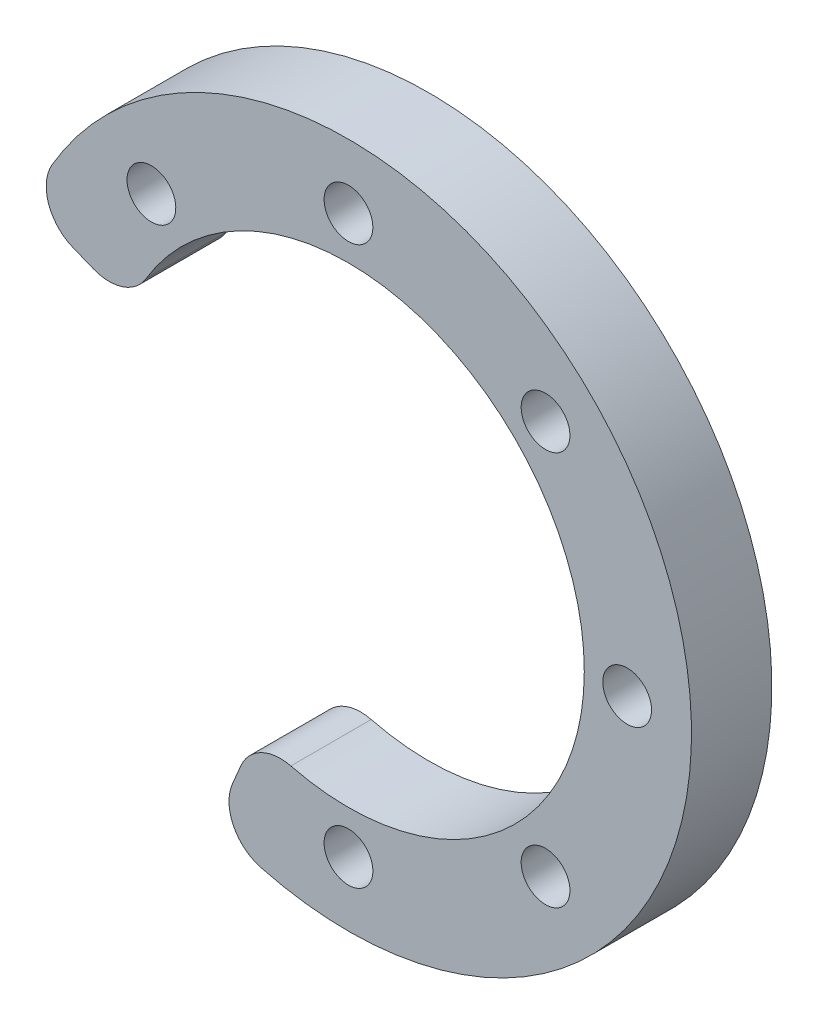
ISO-10303-21;
HEADER;
FILE_DESCRIPTION(('STEP AP214'),'2;1');
FILE_NAME('part.step','',(''),(''),'','','');
FILE_SCHEMA(('AUTOMOTIVE_DESIGN { 1 0 10303 214 1 1 1 1 }'));
ENDSEC;
DATA;
#1=APPLICATION_CONTEXT('core data for automotive mechanical design processes');
#2=APPLICATION_PROTOCOL_DEFINITION('international standard','automotive_design',2000,#1);
#3=PRODUCT_CONTEXT('',#1,'mechanical');
#4=PRODUCT('Part','Part','',(#3));
#5=PRODUCT_RELATED_PRODUCT_CATEGORY('part','',(#4));
#6=PRODUCT_DEFINITION_FORMATION('','',#4);
#7=PRODUCT_DEFINITION_CONTEXT('part definition',#1,'design');
#8=PRODUCT_DEFINITION('design','',#6,#7);
#9=PRODUCT_DEFINITION_SHAPE('','',#8);
#10=(LENGTH_UNIT() NAMED_UNIT(*) SI_UNIT(.MILLI.,.METRE.));
#11=(NAMED_UNIT(*) PLANE_ANGLE_UNIT() SI_UNIT($,.RADIAN.));
#12=(NAMED_UNIT(*) SI_UNIT($,.STERADIAN.) SOLID_ANGLE_UNIT());
#13=UNCERTAINTY_MEASURE_WITH_UNIT(LENGTH_MEASURE(1.E-05),#10,'distance_accuracy_value','');
#14=(GEOMETRIC_REPRESENTATION_CONTEXT(3) GLOBAL_UNCERTAINTY_ASSIGNED_CONTEXT((#13)) GLOBAL_UNIT_ASSIGNED_CONTEXT((#10,
#11,#12)) REPRESENTATION_CONTEXT('',''));
#15=CARTESIAN_POINT('',(0.,0.,0.));
#16=DIRECTION('',(0.,0.,1.));
#17=DIRECTION('',(1.,0.,0.));
#18=AXIS2_PLACEMENT_3D('',#15,#16,#17);
#19=CARTESIAN_POINT('',(-22.3213581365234,13.3325530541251,7.5));
#20=DIRECTION('',(0.,0.,-1.));
#21=DIRECTION('',(-1.,0.,0.));
#22=AXIS2_PLACEMENT_3D('',#19,#20,#21);
#23=CYLINDRICAL_SURFACE('',#22,4.);
#24=CARTESIAN_POINT('',(-22.3213581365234,13.3325530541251,0.));
#25=DIRECTION('',(0.,0.,-1.));
#26=DIRECTION('',(1.,0.,0.));
#27=AXIS2_PLACEMENT_3D('',#24,#25,#26);
#28=CIRCLE('',#27,4.);
#29=CARTESIAN_POINT('',(-18.8873030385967,11.2813910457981,0.));
#30=VERTEX_POINT('',#29);
#31=CARTESIAN_POINT('',(-23.8197845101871,9.62381763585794,0.));
#32=VERTEX_POINT('',#31);
#33=EDGE_CURVE('E137',#30,#32,#28,.T.);
#34=ORIENTED_EDGE('',*,*,#33,.F.);
#35=DIRECTION('',(0.,0.,-1.));
#36=VECTOR('',#35,1.);
#37=CARTESIAN_POINT('',(-18.8873030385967,11.2813910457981,7.5));
#38=LINE('',#37,#36);
#39=CARTESIAN_POINT('',(-18.8873030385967,11.2813910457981,7.5));
#40=VERTEX_POINT('',#39);
#41=EDGE_CURVE('E51',#40,#30,#38,.T.);
#42=ORIENTED_EDGE('',*,*,#41,.F.);
#43=CARTESIAN_POINT('',(-22.3213581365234,13.3325530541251,7.5));
#44=DIRECTION('',(0.,0.,1.));
#45=DIRECTION('',(1.,0.,0.));
#46=AXIS2_PLACEMENT_3D('',#43,#44,#45);
#47=CIRCLE('',#46,4.);
#48=CARTESIAN_POINT('',(-23.8197845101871,9.62381763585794,7.5));
#49=VERTEX_POINT('',#48);
#50=EDGE_CURVE('E178',#49,#40,#47,.T.);
#51=ORIENTED_EDGE('',*,*,#50,.F.);
#52=DIRECTION('',(0.,0.,1.));
#53=VECTOR('',#52,1.);
#54=CARTESIAN_POINT('',(-23.8197845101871,9.62381763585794,7.5));
#55=LINE('',#54,#53);
#56=EDGE_CURVE('E11',#32,#49,#55,.T.);
#57=ORIENTED_EDGE('',*,*,#56,.F.);
#58=EDGE_LOOP('',(#34,#42,#51,#57));
#59=FACE_BOUND('',#58,.T.);
#60=ADVANCED_FACE('F17',(#59),#23,.T.);
#61=CARTESIAN_POINT('',(-6.35604502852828,-25.2111223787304,7.5));
#62=DIRECTION('',(0.,0.,-1.));
#63=DIRECTION('',(-1.,0.,0.));
#64=AXIS2_PLACEMENT_3D('',#61,#62,#63);
#65=CYLINDRICAL_SURFACE('',#64,4.);
#66=CARTESIAN_POINT('',(-6.35604502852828,-25.2111223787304,7.5));
#67=DIRECTION('',(0.,0.,1.));
#68=DIRECTION('',(1.,0.,0.));
#69=AXIS2_PLACEMENT_3D('',#66,#67,#68);
#70=CIRCLE('',#69,4.);
#71=CARTESIAN_POINT('',(-5.37819194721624,-21.332488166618,7.5));
#72=VERTEX_POINT('',#71);
#73=CARTESIAN_POINT('',(-10.038064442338,-23.6481978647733,7.5));
#74=VERTEX_POINT('',#73);
#75=EDGE_CURVE('E131',#72,#74,#70,.T.);
#76=ORIENTED_EDGE('',*,*,#75,.F.);
#77=DIRECTION('',(0.,0.,1.));
#78=VECTOR('',#77,1.);
#79=CARTESIAN_POINT('',(-5.37819194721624,-21.332488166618,7.5));
#80=LINE('',#79,#78);
#81=CARTESIAN_POINT('',(-5.37819194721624,-21.332488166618,0.));
#82=VERTEX_POINT('',#81);
#83=EDGE_CURVE('E113',#82,#72,#80,.T.);
#84=ORIENTED_EDGE('',*,*,#83,.F.);
#85=CARTESIAN_POINT('',(-6.35604502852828,-25.2111223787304,0.));
#86=DIRECTION('',(0.,0.,-1.));
#87=DIRECTION('',(1.,0.,0.));
#88=AXIS2_PLACEMENT_3D('',#85,#86,#87);
#89=CIRCLE('',#88,4.);
#90=CARTESIAN_POINT('',(-10.038064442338,-23.6481978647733,0.));
#91=VERTEX_POINT('',#90);
#92=EDGE_CURVE('E111',#91,#82,#89,.T.);
#93=ORIENTED_EDGE('',*,*,#92,.F.);
#94=DIRECTION('',(0.,0.,-1.));
#95=VECTOR('',#94,1.);
#96=CARTESIAN_POINT('',(-10.038064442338,-23.6481978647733,0.));
#97=LINE('',#96,#95);
#98=EDGE_CURVE('E20',#74,#91,#97,.T.);
#99=ORIENTED_EDGE('',*,*,#98,.F.);
#100=EDGE_LOOP('',(#76,#84,#93,#99));
#101=FACE_BOUND('',#100,.T.);
#102=ADVANCED_FACE('F112',(#101),#65,.T.);
#103=CARTESIAN_POINT('',(0.,0.,0.));
#104=DIRECTION('',(0.374606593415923,0.927183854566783,0.));
#105=DIRECTION('',(0.,0.,-1.));
#106=AXIS2_PLACEMENT_3D('',#103,#104,#105);
#107=PLANE('',#106);
#108=DIRECTION('',(-0.927183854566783,0.374606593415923,0.));
#109=VECTOR('',#108,1.);
#110=CARTESIAN_POINT('',(0.,0.,0.));
#111=LINE('',#110,#109);
#112=CARTESIAN_POINT('',(-25.6948727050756,10.3814024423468,0.));
#113=VERTEX_POINT('',#112);
#114=EDGE_CURVE('E141',#32,#113,#111,.T.);
#115=ORIENTED_EDGE('',*,*,#114,.F.);
#116=ORIENTED_EDGE('',*,*,#56,.T.);
#117=DIRECTION('',(-0.927183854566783,0.374606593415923,0.));
#118=VECTOR('',#117,1.);
#119=CARTESIAN_POINT('',(0.,0.,7.5));
#120=LINE('',#119,#118);
#121=CARTESIAN_POINT('',(-25.6948727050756,10.3814024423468,7.5));
#122=VERTEX_POINT('',#121);
#123=EDGE_CURVE('E167',#49,#122,#120,.T.);
#124=ORIENTED_EDGE('',*,*,#123,.T.);
#125=DIRECTION('',(0.,0.,-1.));
#126=VECTOR('',#125,1.);
#127=CARTESIAN_POINT('',(-25.6948727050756,10.3814024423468,0.));
#128=LINE('',#127,#126);
#129=EDGE_CURVE('E276',#122,#113,#128,.T.);
#130=ORIENTED_EDGE('',*,*,#129,.T.);
#131=EDGE_LOOP('',(#115,#116,#124,#130));
#132=FACE_BOUND('',#131,.T.);
#133=ADVANCED_FACE('F265',(#132),#107,.F.);
#134=CARTESIAN_POINT('',(0.,0.,0.));
#135=DIRECTION('',(0.92050485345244,-0.390731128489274,0.));
#136=DIRECTION('',(0.,0.,-1.));
#137=AXIS2_PLACEMENT_3D('',#134,#135,#136);
#138=PLANE('',#137);
#139=DIRECTION('',(0.390731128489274,0.92050485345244,0.));
#140=VECTOR('',#139,1.);
#141=CARTESIAN_POINT('',(0.,0.,0.));
#142=LINE('',#141,#140);
#143=CARTESIAN_POINT('',(-10.8282586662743,-25.5097787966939,0.));
#144=VERTEX_POINT('',#143);
#145=EDGE_CURVE('E102',#144,#91,#142,.T.);
#146=ORIENTED_EDGE('',*,*,#145,.F.);
#147=DIRECTION('',(0.,0.,1.));
#148=VECTOR('',#147,1.);
#149=CARTESIAN_POINT('',(-10.8282586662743,-25.5097787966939,0.));
#150=LINE('',#149,#148);
#151=CARTESIAN_POINT('',(-10.8282586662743,-25.5097787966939,7.5));
#152=VERTEX_POINT('',#151);
#153=EDGE_CURVE('E109',#144,#152,#150,.T.);
#154=ORIENTED_EDGE('',*,*,#153,.T.);
#155=DIRECTION('',(0.390731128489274,0.92050485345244,0.));
#156=VECTOR('',#155,1.);
#157=CARTESIAN_POINT('',(0.,0.,7.5));
#158=LINE('',#157,#156);
#159=EDGE_CURVE('E104',#152,#74,#158,.T.);
#160=ORIENTED_EDGE('',*,*,#159,.T.);
#161=ORIENTED_EDGE('',*,*,#98,.T.);
#162=EDGE_LOOP('',(#146,#154,#160,#161));
#163=FACE_BOUND('',#162,.T.);
#164=ADVANCED_FACE('F99',(#163),#138,.F.);
#165=CARTESIAN_POINT('',(0.,0.,7.5));
#166=DIRECTION('',(0.,0.,-1.));
#167=DIRECTION('',(-1.,0.,0.));
#168=AXIS2_PLACEMENT_3D('',#165,#166,#167);
#169=CYLINDRICAL_SURFACE('',#168,22.);
#170=CARTESIAN_POINT('',(0.,0.,0.));
#171=DIRECTION('',(0.,0.,1.));
#172=DIRECTION('',(1.,0.,0.));
#173=AXIS2_PLACEMENT_3D('',#170,#171,#172);
#174=CIRCLE('',#173,22.);
#175=EDGE_CURVE('E117',#82,#30,#174,.T.);
#176=ORIENTED_EDGE('',*,*,#175,.F.);
#177=ORIENTED_EDGE('',*,*,#83,.T.);
#178=CARTESIAN_POINT('',(0.,0.,7.5));
#179=DIRECTION('',(0.,0.,1.));
#180=DIRECTION('',(1.,0.,0.));
#181=AXIS2_PLACEMENT_3D('',#178,#179,#180);
#182=CIRCLE('',#181,22.);
#183=EDGE_CURVE('E181',#72,#40,#182,.T.);
#184=ORIENTED_EDGE('',*,*,#183,.T.);
#185=ORIENTED_EDGE('',*,*,#41,.T.);
#186=EDGE_LOOP('',(#176,#177,#184,#185));
#187=FACE_BOUND('',#186,.T.);
#188=ADVANCED_FACE('F267',(#187),#169,.F.);
#189=CARTESIAN_POINT('',(0.,0.,7.5));
#190=DIRECTION('',(0.,0.,-1.));
#191=DIRECTION('',(-1.,0.,0.));
#192=AXIS2_PLACEMENT_3D('',#189,#190,#191);
#193=CYLINDRICAL_SURFACE('',#192,32.);
#194=CARTESIAN_POINT('',(0.,0.,7.5));
#195=DIRECTION('',(0.,0.,1.));
#196=DIRECTION('',(1.,0.,0.));
#197=AXIS2_PLACEMENT_3D('',#194,#195,#196);
#198=CIRCLE('',#197,32.);
#199=CARTESIAN_POINT('',(-8.16713057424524,-30.9402323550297,7.5));
#200=VERTEX_POINT('',#199);
#201=CARTESIAN_POINT('',(-27.6530815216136,16.1030146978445,7.5));
#202=VERTEX_POINT('',#201);
#203=EDGE_CURVE('E160',#200,#202,#198,.T.);
#204=ORIENTED_EDGE('',*,*,#203,.F.);
#205=DIRECTION('',(0.,0.,-1.));
#206=VECTOR('',#205,1.);
#207=CARTESIAN_POINT('',(-8.16713057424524,-30.9402323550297,7.5));
#208=LINE('',#207,#206);
#209=CARTESIAN_POINT('',(-8.16713057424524,-30.9402323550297,0.));
#210=VERTEX_POINT('',#209);
#211=EDGE_CURVE('E215',#200,#210,#208,.T.);
#212=ORIENTED_EDGE('',*,*,#211,.T.);
#213=CARTESIAN_POINT('',(0.,0.,0.));
#214=DIRECTION('',(0.,0.,1.));
#215=DIRECTION('',(1.,0.,0.));
#216=AXIS2_PLACEMENT_3D('',#213,#214,#215);
#217=CIRCLE('',#216,32.);
#218=CARTESIAN_POINT('',(-27.6530815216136,16.1030146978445,0.));
#219=VERTEX_POINT('',#218);
#220=EDGE_CURVE('E124',#210,#219,#217,.T.);
#221=ORIENTED_EDGE('',*,*,#220,.T.);
#222=DIRECTION('',(0.,0.,1.));
#223=VECTOR('',#222,1.);
#224=CARTESIAN_POINT('',(-27.6530815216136,16.1030146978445,7.5));
#225=LINE('',#224,#223);
#226=EDGE_CURVE('E142',#219,#202,#225,.T.);
#227=ORIENTED_EDGE('',*,*,#226,.T.);
#228=EDGE_LOOP('',(#204,#212,#221,#227));
#229=FACE_BOUND('',#228,.T.);
#230=ADVANCED_FACE('F311',(#229),#193,.T.);
#231=CARTESIAN_POINT('',(0.,0.,0.));
#232=DIRECTION('',(0.,0.,1.));
#233=DIRECTION('',(1.,0.,0.));
#234=AXIS2_PLACEMENT_3D('',#231,#232,#233);
#235=PLANE('',#234);
#236=CARTESIAN_POINT('',(0.,26.,0.));
#237=DIRECTION('',(0.,0.,1.));
#238=DIRECTION('',(1.,0.,0.));
#239=AXIS2_PLACEMENT_3D('',#236,#237,#238);
#240=CIRCLE('',#239,2.275);
#241=CARTESIAN_POINT('',(2.275,26.,0.));
#242=VERTEX_POINT('',#241);
#243=EDGE_CURVE('E171',#242,#242,#240,.T.);
#244=ORIENTED_EDGE('',*,*,#243,.T.);
#245=EDGE_LOOP('',(#244));
#246=FACE_BOUND('',#245,.T.);
#247=CARTESIAN_POINT('',(18.3847763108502,18.3847763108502,0.));
#248=DIRECTION('',(0.,0.,1.));
#249=DIRECTION('',(0.707106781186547,-0.707106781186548,0.));
#250=AXIS2_PLACEMENT_3D('',#247,#248,#249);
#251=CIRCLE('',#250,2.275);
#252=CARTESIAN_POINT('',(19.9934442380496,16.7761083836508,0.));
#253=VERTEX_POINT('',#252);
#254=EDGE_CURVE('E196',#253,#253,#251,.T.);
#255=ORIENTED_EDGE('',*,*,#254,.T.);
#256=EDGE_LOOP('',(#255));
#257=FACE_BOUND('',#256,.T.);
#258=CARTESIAN_POINT('',(-18.38477631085,18.3847763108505,0.));
#259=DIRECTION('',(0.,0.,1.));
#260=DIRECTION('',(0.707106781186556,0.707106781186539,0.));
#261=AXIS2_PLACEMENT_3D('',#258,#259,#260);
#262=CIRCLE('',#261,2.275);
#263=CARTESIAN_POINT('',(-16.7761083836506,19.9934442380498,0.));
#264=VERTEX_POINT('',#263);
#265=EDGE_CURVE('E212',#264,#264,#262,.T.);
#266=ORIENTED_EDGE('',*,*,#265,.T.);
#267=EDGE_LOOP('',(#266));
#268=FACE_BOUND('',#267,.T.);
#269=CARTESIAN_POINT('',(0.,-26.,0.));
#270=DIRECTION('',(0.,0.,1.));
#271=DIRECTION('',(-1.,0.,0.));
#272=AXIS2_PLACEMENT_3D('',#269,#270,#271);
#273=CIRCLE('',#272,2.275);
#274=CARTESIAN_POINT('',(-2.275,-26.,0.));
#275=VERTEX_POINT('',#274);
#276=EDGE_CURVE('E221',#275,#275,#273,.T.);
#277=ORIENTED_EDGE('',*,*,#276,.T.);
#278=EDGE_LOOP('',(#277));
#279=FACE_BOUND('',#278,.T.);
#280=CARTESIAN_POINT('',(18.3847763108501,-18.3847763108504,0.));
#281=DIRECTION('',(0.,0.,1.));
#282=DIRECTION('',(-0.707106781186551,-0.707106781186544,0.));
#283=AXIS2_PLACEMENT_3D('',#280,#281,#282);
#284=CIRCLE('',#283,2.275);
#285=CARTESIAN_POINT('',(16.7761083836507,-19.9934442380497,0.));
#286=VERTEX_POINT('',#285);
#287=EDGE_CURVE('E222',#286,#286,#284,.T.);
#288=ORIENTED_EDGE('',*,*,#287,.T.);
#289=EDGE_LOOP('',(#288));
#290=FACE_BOUND('',#289,.T.);
#291=CARTESIAN_POINT('',(26.,0.,0.));
#292=DIRECTION('',(0.,0.,1.));
#293=DIRECTION('',(0.,-1.,0.));
#294=AXIS2_PLACEMENT_3D('',#291,#292,#293);
#295=CIRCLE('',#294,2.275);
#296=CARTESIAN_POINT('',(26.,-2.27500000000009,0.));
#297=VERTEX_POINT('',#296);
#298=EDGE_CURVE('E223',#297,#297,#295,.T.);
#299=ORIENTED_EDGE('',*,*,#298,.T.);
#300=EDGE_LOOP('',(#299));
#301=FACE_BOUND('',#300,.T.);
#302=ORIENTED_EDGE('',*,*,#220,.F.);
#303=CARTESIAN_POINT('',(-7.14623925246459,-27.072703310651,0.));
#304=DIRECTION('',(0.,0.,-1.));
#305=DIRECTION('',(1.,0.,0.));
#306=AXIS2_PLACEMENT_3D('',#303,#304,#305);
#307=CIRCLE('',#306,4.);
#308=EDGE_CURVE('E121',#210,#144,#307,.T.);
#309=ORIENTED_EDGE('',*,*,#308,.T.);
#310=ORIENTED_EDGE('',*,*,#145,.T.);
#311=ORIENTED_EDGE('',*,*,#92,.T.);
#312=ORIENTED_EDGE('',*,*,#175,.T.);
#313=ORIENTED_EDGE('',*,*,#33,.T.);
#314=ORIENTED_EDGE('',*,*,#114,.T.);
#315=CARTESIAN_POINT('',(-24.1964463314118,14.0901378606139,0.));
#316=DIRECTION('',(0.,0.,-1.));
#317=DIRECTION('',(1.,0.,0.));
#318=AXIS2_PLACEMENT_3D('',#315,#316,#317);
#319=CIRCLE('',#318,4.);
#320=EDGE_CURVE('E283',#113,#219,#319,.T.);
#321=ORIENTED_EDGE('',*,*,#320,.T.);
#322=EDGE_LOOP('',(#302,#309,#310,#311,#312,#313,#314,#321));
#323=FACE_BOUND('',#322,.T.);
#324=ADVANCED_FACE('F119',(#246,#257,#268,#279,#290,#301,#323),#235,.F.);
#325=CARTESIAN_POINT('',(0.,0.,7.5));
#326=DIRECTION('',(0.,0.,1.));
#327=DIRECTION('',(1.,0.,0.));
#328=AXIS2_PLACEMENT_3D('',#325,#326,#327);
#329=PLANE('',#328);
#330=CARTESIAN_POINT('',(0.,26.,7.5));
#331=DIRECTION('',(0.,0.,1.));
#332=DIRECTION('',(1.,0.,0.));
#333=AXIS2_PLACEMENT_3D('',#330,#331,#332);
#334=CIRCLE('',#333,2.275);
#335=CARTESIAN_POINT('',(2.275,26.,7.5));
#336=VERTEX_POINT('',#335);
#337=EDGE_CURVE('E161',#336,#336,#334,.T.);
#338=ORIENTED_EDGE('',*,*,#337,.F.);
#339=EDGE_LOOP('',(#338));
#340=FACE_BOUND('',#339,.T.);
#341=CARTESIAN_POINT('',(18.3847763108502,18.3847763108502,7.5));
#342=DIRECTION('',(0.,0.,1.));
#343=DIRECTION('',(0.707106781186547,-0.707106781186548,0.));
#344=AXIS2_PLACEMENT_3D('',#341,#342,#343);
#345=CIRCLE('',#344,2.275);
#346=CARTESIAN_POINT('',(19.9934442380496,16.7761083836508,7.5));
#347=VERTEX_POINT('',#346);
#348=EDGE_CURVE('E193',#347,#347,#345,.T.);
#349=ORIENTED_EDGE('',*,*,#348,.F.);
#350=EDGE_LOOP('',(#349));
#351=FACE_BOUND('',#350,.T.);
#352=CARTESIAN_POINT('',(-18.38477631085,18.3847763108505,7.5));
#353=DIRECTION('',(0.,0.,1.));
#354=DIRECTION('',(0.707106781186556,0.707106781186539,0.));
#355=AXIS2_PLACEMENT_3D('',#352,#353,#354);
#356=CIRCLE('',#355,2.275);
#357=CARTESIAN_POINT('',(-16.7761083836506,19.9934442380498,7.5));
#358=VERTEX_POINT('',#357);
#359=EDGE_CURVE('E191',#358,#358,#356,.T.);
#360=ORIENTED_EDGE('',*,*,#359,.F.);
#361=EDGE_LOOP('',(#360));
#362=FACE_BOUND('',#361,.T.);
#363=CARTESIAN_POINT('',(0.,-26.,7.5));
#364=DIRECTION('',(0.,0.,1.));
#365=DIRECTION('',(-1.,0.,0.));
#366=AXIS2_PLACEMENT_3D('',#363,#364,#365);
#367=CIRCLE('',#366,2.275);
#368=CARTESIAN_POINT('',(-2.275,-26.,7.5));
#369=VERTEX_POINT('',#368);
#370=EDGE_CURVE('E234',#369,#369,#367,.T.);
#371=ORIENTED_EDGE('',*,*,#370,.F.);
#372=EDGE_LOOP('',(#371));
#373=FACE_BOUND('',#372,.T.);
#374=CARTESIAN_POINT('',(18.3847763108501,-18.3847763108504,7.5));
#375=DIRECTION('',(0.,0.,1.));
#376=DIRECTION('',(-0.707106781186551,-0.707106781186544,0.));
#377=AXIS2_PLACEMENT_3D('',#374,#375,#376);
#378=CIRCLE('',#377,2.275);
#379=CARTESIAN_POINT('',(16.7761083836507,-19.9934442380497,7.5));
#380=VERTEX_POINT('',#379);
#381=EDGE_CURVE('E217',#380,#380,#378,.T.);
#382=ORIENTED_EDGE('',*,*,#381,.F.);
#383=EDGE_LOOP('',(#382));
#384=FACE_BOUND('',#383,.T.);
#385=CARTESIAN_POINT('',(26.,0.,7.5));
#386=DIRECTION('',(0.,0.,1.));
#387=DIRECTION('',(0.,-1.,0.));
#388=AXIS2_PLACEMENT_3D('',#385,#386,#387);
#389=CIRCLE('',#388,2.275);
#390=CARTESIAN_POINT('',(26.,-2.27500000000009,7.5));
#391=VERTEX_POINT('',#390);
#392=EDGE_CURVE('E227',#391,#391,#389,.T.);
#393=ORIENTED_EDGE('',*,*,#392,.F.);
#394=EDGE_LOOP('',(#393));
#395=FACE_BOUND('',#394,.T.);
#396=ORIENTED_EDGE('',*,*,#159,.F.);
#397=CARTESIAN_POINT('',(-7.14623925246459,-27.072703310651,7.5));
#398=DIRECTION('',(0.,0.,1.));
#399=DIRECTION('',(1.,0.,0.));
#400=AXIS2_PLACEMENT_3D('',#397,#398,#399);
#401=CIRCLE('',#400,4.);
#402=EDGE_CURVE('E157',#152,#200,#401,.T.);
#403=ORIENTED_EDGE('',*,*,#402,.T.);
#404=ORIENTED_EDGE('',*,*,#203,.T.);
#405=CARTESIAN_POINT('',(-24.1964463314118,14.0901378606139,7.5));
#406=DIRECTION('',(0.,0.,1.));
#407=DIRECTION('',(1.,0.,0.));
#408=AXIS2_PLACEMENT_3D('',#405,#406,#407);
#409=CIRCLE('',#408,4.);
#410=EDGE_CURVE('E271',#202,#122,#409,.T.);
#411=ORIENTED_EDGE('',*,*,#410,.T.);
#412=ORIENTED_EDGE('',*,*,#123,.F.);
#413=ORIENTED_EDGE('',*,*,#50,.T.);
#414=ORIENTED_EDGE('',*,*,#183,.F.);
#415=ORIENTED_EDGE('',*,*,#75,.T.);
#416=EDGE_LOOP('',(#396,#403,#404,#411,#412,#413,#414,#415));
#417=FACE_BOUND('',#416,.T.);
#418=ADVANCED_FACE('F155',(#340,#351,#362,#373,#384,#395,#417),#329,.T.);
#419=CARTESIAN_POINT('',(0.,26.,0.));
#420=DIRECTION('',(0.,0.,1.));
#421=DIRECTION('',(1.,0.,0.));
#422=AXIS2_PLACEMENT_3D('',#419,#420,#421);
#423=CYLINDRICAL_SURFACE('',#422,2.275);
#424=ORIENTED_EDGE('',*,*,#337,.T.);
#425=EDGE_LOOP('',(#424));
#426=FACE_BOUND('',#425,.T.);
#427=ORIENTED_EDGE('',*,*,#243,.F.);
#428=EDGE_LOOP('',(#427));
#429=FACE_BOUND('',#428,.T.);
#430=ADVANCED_FACE('F259',(#426,#429),#423,.F.);
#431=CARTESIAN_POINT('',(18.3847763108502,18.3847763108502,0.));
#432=DIRECTION('',(0.,0.,1.));
#433=DIRECTION('',(1.,0.,0.));
#434=AXIS2_PLACEMENT_3D('',#431,#432,#433);
#435=CYLINDRICAL_SURFACE('',#434,2.275);
#436=ORIENTED_EDGE('',*,*,#348,.T.);
#437=EDGE_LOOP('',(#436));
#438=FACE_BOUND('',#437,.T.);
#439=ORIENTED_EDGE('',*,*,#254,.F.);
#440=EDGE_LOOP('',(#439));
#441=FACE_BOUND('',#440,.T.);
#442=ADVANCED_FACE('F248',(#438,#441),#435,.F.);
#443=CARTESIAN_POINT('',(-18.38477631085,18.3847763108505,0.));
#444=DIRECTION('',(0.,0.,1.));
#445=DIRECTION('',(1.,0.,0.));
#446=AXIS2_PLACEMENT_3D('',#443,#444,#445);
#447=CYLINDRICAL_SURFACE('',#446,2.275);
#448=ORIENTED_EDGE('',*,*,#359,.T.);
#449=EDGE_LOOP('',(#448));
#450=FACE_BOUND('',#449,.T.);
#451=ORIENTED_EDGE('',*,*,#265,.F.);
#452=EDGE_LOOP('',(#451));
#453=FACE_BOUND('',#452,.T.);
#454=ADVANCED_FACE('F245',(#450,#453),#447,.F.);
#455=CARTESIAN_POINT('',(0.,-26.,0.));
#456=DIRECTION('',(0.,0.,1.));
#457=DIRECTION('',(1.,0.,0.));
#458=AXIS2_PLACEMENT_3D('',#455,#456,#457);
#459=CYLINDRICAL_SURFACE('',#458,2.275);
#460=ORIENTED_EDGE('',*,*,#370,.T.);
#461=EDGE_LOOP('',(#460));
#462=FACE_BOUND('',#461,.T.);
#463=ORIENTED_EDGE('',*,*,#276,.F.);
#464=EDGE_LOOP('',(#463));
#465=FACE_BOUND('',#464,.T.);
#466=ADVANCED_FACE('F247',(#462,#465),#459,.F.);
#467=CARTESIAN_POINT('',(18.3847763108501,-18.3847763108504,0.));
#468=DIRECTION('',(0.,0.,1.));
#469=DIRECTION('',(1.,0.,0.));
#470=AXIS2_PLACEMENT_3D('',#467,#468,#469);
#471=CYLINDRICAL_SURFACE('',#470,2.275);
#472=ORIENTED_EDGE('',*,*,#381,.T.);
#473=EDGE_LOOP('',(#472));
#474=FACE_BOUND('',#473,.T.);
#475=ORIENTED_EDGE('',*,*,#287,.F.);
#476=EDGE_LOOP('',(#475));
#477=FACE_BOUND('',#476,.T.);
#478=ADVANCED_FACE('F256',(#474,#477),#471,.F.);
#479=CARTESIAN_POINT('',(26.,0.,0.));
#480=DIRECTION('',(0.,0.,1.));
#481=DIRECTION('',(1.,0.,0.));
#482=AXIS2_PLACEMENT_3D('',#479,#480,#481);
#483=CYLINDRICAL_SURFACE('',#482,2.275);
#484=ORIENTED_EDGE('',*,*,#392,.T.);
#485=EDGE_LOOP('',(#484));
#486=FACE_BOUND('',#485,.T.);
#487=ORIENTED_EDGE('',*,*,#298,.F.);
#488=EDGE_LOOP('',(#487));
#489=FACE_BOUND('',#488,.T.);
#490=ADVANCED_FACE('F314',(#486,#489),#483,.F.);
#491=CARTESIAN_POINT('',(-7.14623925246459,-27.072703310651,7.5));
#492=DIRECTION('',(0.,0.,-1.));
#493=DIRECTION('',(-1.,0.,0.));
#494=AXIS2_PLACEMENT_3D('',#491,#492,#493);
#495=CYLINDRICAL_SURFACE('',#494,4.);
#496=ORIENTED_EDGE('',*,*,#402,.F.);
#497=ORIENTED_EDGE('',*,*,#153,.F.);
#498=ORIENTED_EDGE('',*,*,#308,.F.);
#499=ORIENTED_EDGE('',*,*,#211,.F.);
#500=EDGE_LOOP('',(#496,#497,#498,#499));
#501=FACE_BOUND('',#500,.T.);
#502=ADVANCED_FACE('F312',(#501),#495,.T.);
#503=CARTESIAN_POINT('',(-24.1964463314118,14.0901378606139,7.5));
#504=DIRECTION('',(0.,0.,-1.));
#505=DIRECTION('',(-1.,0.,0.));
#506=AXIS2_PLACEMENT_3D('',#503,#504,#505);
#507=CYLINDRICAL_SURFACE('',#506,4.);
#508=ORIENTED_EDGE('',*,*,#410,.F.);
#509=ORIENTED_EDGE('',*,*,#226,.F.);
#510=ORIENTED_EDGE('',*,*,#320,.F.);
#511=ORIENTED_EDGE('',*,*,#129,.F.);
#512=EDGE_LOOP('',(#508,#509,#510,#511));
#513=FACE_BOUND('',#512,.T.);
#514=ADVANCED_FACE('F281',(#513),#507,.T.);
#515=CLOSED_SHELL('',(#60,#102,#133,#164,#188,#230,#324,#418,#430,#442,#454,#466,#478,#490,#502,#514));
#516=MANIFOLD_SOLID_BREP('B1',#515);
#517=ADVANCED_BREP_SHAPE_REPRESENTATION('',(#18,#516),#14);
#518=SHAPE_DEFINITION_REPRESENTATION(#9,#517);
ENDSEC;
END-ISO-10303-21;
